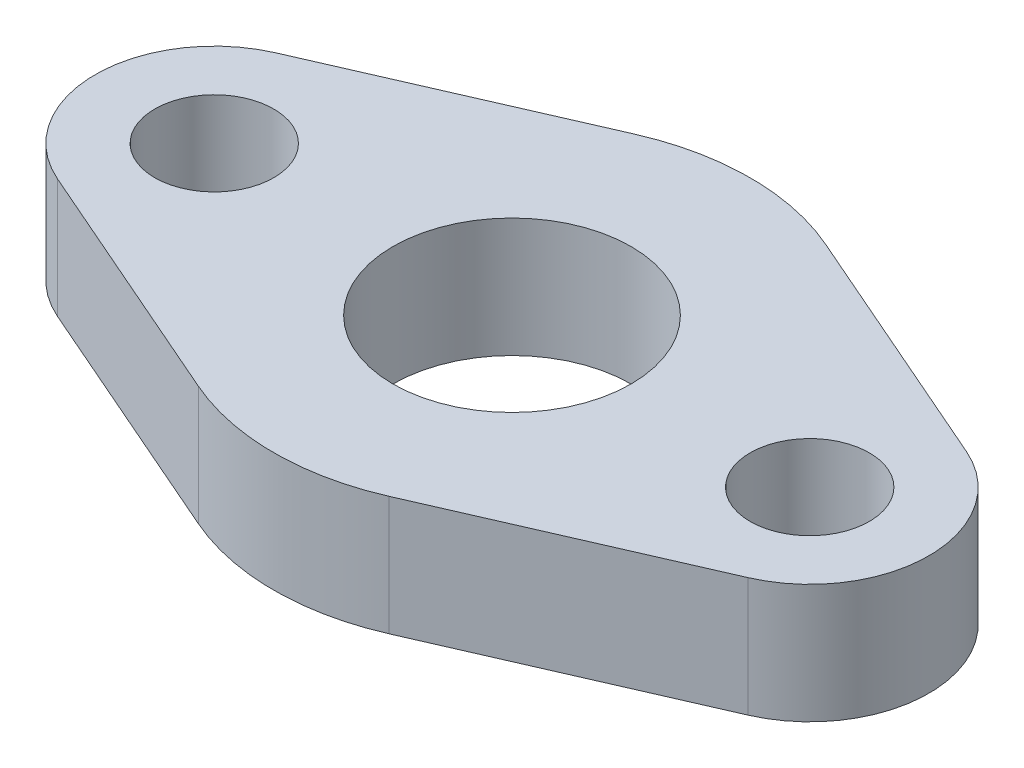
from build123d import *

# Parameters (mm, degrees)
SKETCH1_R      = 40
SKETCH1_R_2    = 20
EXTRUDE1_DEPTH = 40


with BuildPart() as part:
    # Sketch1 → Extrude1 (new body)
    with BuildSketch(Plane(origin=(0, 0, 0), x_dir=(1, 0, 0), z_dir=(0, 1, 0))):
        with BuildLine():
            Line((32, 73.321211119), (116, 36.66060556))
            ThreePointArc((116, 36.66060556), (140, 0), (116, -36.66060556))
            Line((116, -36.66060556), (32, -73.321211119))
            ThreePointArc((32, -73.321211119), (0, -80), (-32, -73.321211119))
            Line((-32, -73.321211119), (-116, -36.66060556))
            ThreePointArc((-116, -36.66060556), (-140, 0), (-116, 36.66060556))
            Line((-116, 36.66060556), (-32, 73.321211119))
            ThreePointArc((-32, 73.321211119), (0, 80), (32, 73.321211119))
        make_face()
        with Locations(Location((0, 0, 0), (0, 0, 270))):
            Circle(SKETCH1_R, mode=Mode.SUBTRACT)
        with Locations(Location((100, 0, 0), (0, 0, 270))):
            Circle(SKETCH1_R_2, mode=Mode.SUBTRACT)
        with Locations(Location((-100, 0, 0), (0, 0, 270))):
            Circle(SKETCH1_R_2, mode=Mode.SUBTRACT)
    extrude(amount=EXTRUDE1_DEPTH)


solid = part.part
